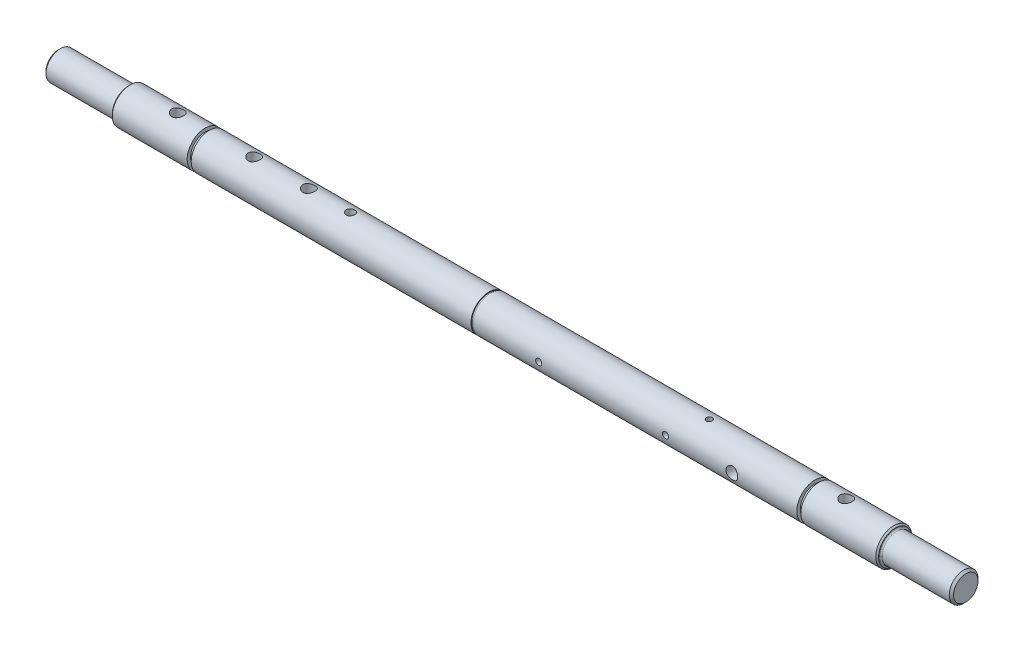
from build123d import *

# Parameters (mm, degrees)
ESQUISSE2_R             = 4.125
ESQUISSE2_R_2           = 2
ESQUISSE2_R_3           = 2.05
ENL_V_MAT_EXTRU_1_DEPTH = 15
ESQUISSE3_R             = 4.125
ESQUISSE3_R_2           = 2.1
ENL_V_MAT_EXTRU_2_DEPTH = 15
ESQUISSE4_R             = 3
ENL_V_MAT_EXTRU_3_DEPTH = 631.247967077


with BuildPart() as part:
    # Esquisse1 → Base-R_volution (revolve)
    with BuildSketch(Plane.XY, mode=Mode.PRIVATE) as base_r_volution_sk:
        with BuildLine():
            Line((0, 0), (0, 8.5))
            Line((0, 8.5), (1.5, 10))
            Line((1.5, 10), (48, 10))
            ThreePointArc((48, 10), (48.707106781, 10.292893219), (49, 11))
            Line((49, 11), (49, 11.5))
            Line((49, 11.5), (50, 12.5))
            Line((50, 12.5), (102, 12.5))
            Line((102, 12.5), (102, 10.1))
            Line((102, 10.1), (104.8, 10.1))
            Line((104.8, 10.1), (104.8, 12.5))
            Line((104.8, 12.5), (299, 12.5))
            Line((299, 12.5), (299, 11.95))
            Line((299, 11.95), (300.3, 11.95))
            Line((300.3, 11.95), (300.3, 12.5))
            Line((300.3, 12.5), (525.2, 12.5))
            Line((525.2, 12.5), (525.2, 10.1))
            Line((525.2, 10.1), (528, 10.1))
            Line((528, 10.1), (528, 12.5))
            Line((528, 12.5), (580, 12.5))
            Line((580, 12.5), (581, 11.5))
            Line((581, 11.5), (581, 11))
            ThreePointArc((581, 11), (581.292893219, 10.292893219), (582, 10))
            Line((582, 10), (628.5, 10))
            Line((628.5, 10), (630, 8.5))
            Line((630, 8.5), (630, 0))
            Line((630, 0), (0, 0))
        make_face()
    revolve(base_r_volution_sk.sketch.rotate(Axis((0, 0, 0), (1, 0, 0)), 90), axis=Axis((0, 0, 0), (1, 0, 0)))

    # Esquisse2 → Enl_v. mat.-Extru.1 (cut, symmetric)
    with BuildSketch(Plane(origin=(0, 0, 0), x_dir=(1, 0, 0), z_dir=(0, 1, 0))):
        with Locations(Location((83, 0, 0), (0, 0, 270))):
            Circle(ESQUISSE2_R)
        with Locations(Location((136, 0, 0), (0, 0, 270))):
            Circle(ESQUISSE2_R)
        with Locations(Location((174, 0, 0), (0, 0, 270))):
            Circle(ESQUISSE2_R)
        with Locations(Location((203, 0, 0), (0, 0, 270))):
            Circle(ESQUISSE2_R_2)
        with Locations(Location((547, 0, 0), (0, 0, 270))):
            Circle(ESQUISSE2_R)
        with Locations(Location((452, 0, 0), (0, 0, 270))):
            Circle(ESQUISSE2_R_3)
    extrude(amount=ENL_V_MAT_EXTRU_1_DEPTH, both=True, mode=Mode.SUBTRACT)

    # Esquisse3 → Enl_v. mat.-Extru.2 (cut, symmetric)
    with BuildSketch(Plane.XY):
        with Locations((480, 0)):
            Circle(ESQUISSE3_R)
        with Locations((434, 0)):
            Circle(ESQUISSE3_R_2)
        with Locations((346, 0)):
            Circle(ESQUISSE3_R_2)
    extrude(amount=ENL_V_MAT_EXTRU_2_DEPTH, both=True, mode=Mode.SUBTRACT)

    # Esquisse4 → Enl_v. mat.-Extru.3 (cut, through all)
    with BuildSketch(Plane(origin=(0, 0, 0), x_dir=(1, 0, 0), z_dir=(0, 1, 0))):
        with Locations(Location((203, 0, 0), (0, 0, 180))):
            Circle(ESQUISSE4_R)
    extrude(amount=ENL_V_MAT_EXTRU_3_DEPTH, mode=Mode.SUBTRACT)


solid = part.part
